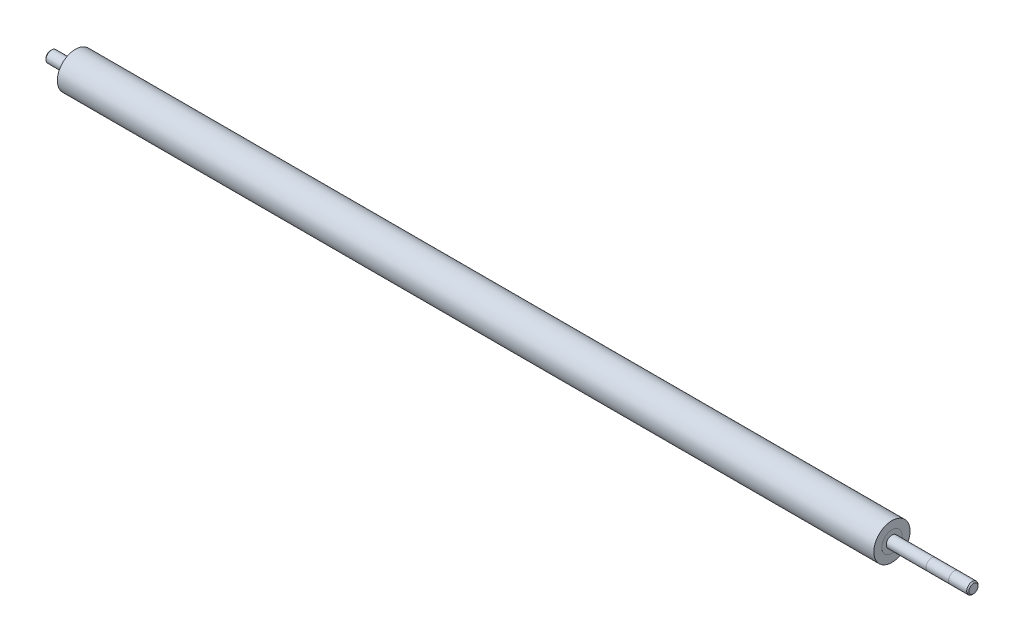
from build123d import *

# Parameters (mm, degrees)
SKETCH1_R               = 20
SKETCH1_R_2             = 7.5
EXTRUDE1_DEPTH          = 360.5
EXTRUDE2_DEPTH          = 362.607867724
EXTRUDE2_DEPTH_BACK     = 362.607867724
SKETCH2_R               = 9
EXTRUDE3_DEPTH          = 362.607867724
EXTRUDE3_DEPTH_BACK     = 362.607867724
SKETCH3_OUTSIDE_W       = 186.644
SKETCH3_OUTSIDE_H       = 186.644
SKETCH3_OUTSIDE_R       = 16
SKETCH4_R               = 9
SKETCH4_R_2             = 7
STAHLROHR_D18_X_2_DEPTH = 315.5
EXTRUDE5_DEPTH          = 72
EXTRUDE5_DEPTH_BACK     = 38
SKETCH6_R               = 5
CHAMFER1_SIZE           = 0.5
CHAMFER2_SIZE           = 1
EXTRUDE6_DEPTH          = 22
EXTRUDE6_DEPTH_BACK     = 38
SKETCH7_R               = 5
CHAMFER3_SIZE           = 0.5
CHAMFER4_SIZE           = 1


with BuildPart() as part:
    # Sketch1 → Extrude1 (new, symmetric)
    with BuildSketch(Plane(origin=(0, 0, 0), x_dir=(0, 0, -1), z_dir=(1, 0, 0))):
        Circle(SKETCH1_R)
        Circle(SKETCH1_R_2, mode=Mode.SUBTRACT)
    extrude(amount=EXTRUDE1_DEPTH, both=True)

    # Sketch2 → Extrude2 (cut, two sides: drawn at the far end of the back side and taken through both)
    with BuildSketch(Plane(origin=(0, 0, 0), x_dir=(0, 0, -1), z_dir=(1, 0, 0)).offset(-EXTRUDE2_DEPTH_BACK)):
        Circle(SKETCH2_R)
    extrude(amount=EXTRUDE2_DEPTH + EXTRUDE2_DEPTH_BACK, mode=Mode.SUBTRACT)

    # Sketch3 outside → Extrude3 (cut, two sides: drawn at the far end of the back side and taken through both)
    with BuildSketch(Plane(origin=(0, 0, 0), x_dir=(0, 0, -1), z_dir=(1, 0, 0)).offset(-EXTRUDE3_DEPTH_BACK)):
        Rectangle(SKETCH3_OUTSIDE_W, SKETCH3_OUTSIDE_H)
        Circle(SKETCH3_OUTSIDE_R, mode=Mode.SUBTRACT)
    extrude(amount=EXTRUDE3_DEPTH + EXTRUDE3_DEPTH_BACK, mode=Mode.SUBTRACT)


with BuildPart() as body_2:
    # Sketch4 → Stahlrohr d18 x 2 (new, symmetric)
    with BuildSketch(Plane(origin=(0, 0, 0), x_dir=(0, 0, -1), z_dir=(1, 0, 0))):
        Circle(SKETCH4_R)
        Circle(SKETCH4_R_2, mode=Mode.SUBTRACT)
    extrude(amount=STAHLROHR_D18_X_2_DEPTH, both=True)


with BuildPart() as body_3:
    # Sketch5 → Stopfen AS (revolve)
    with BuildSketch(Plane.XY):
        Polygon((298.5, 0), (298.5, 6), (299.5, 7), (318.5, 7), (318.5, 9), (360.5, 9), (360.5, 5), (322.5, 5), (322.5, 3), (320.767949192, 0), align=None)
    revolve(axis=Axis((360.5, 0, 0), (-1, 0, 0)))


with BuildPart() as body_4:
    # Stopfen RS: mirrored copy
    add(body_3.part.mirror(Plane(origin=(0, 0, 0), x_dir=(0, 0, 1), z_dir=(1, 0, 0))))


with BuildPart() as body_5:
    # Sketch6 → Extrude5 (new, two sides: drawn at the far end of the back side and taken through both)
    with BuildSketch(Plane(origin=(360.5, 0, 0), x_dir=(0, 0, -1), z_dir=(1, 0, 0)).offset(-EXTRUDE5_DEPTH_BACK)):
        with Locations(Location((0, 0, 0), (0, 0, 90))):
            Circle(SKETCH6_R)
    extrude(amount=EXTRUDE5_DEPTH + EXTRUDE5_DEPTH_BACK)

    # Chamfer1
    chamfer1_edges = [body_5.edges().sort_by_distance(p)[0] for p in [
        (322.5, -5, 0),
    ]]
    chamfer(chamfer1_edges, length=CHAMFER1_SIZE)

    # Chamfer2
    chamfer2_edges = [body_5.edges().sort_by_distance(p)[0] for p in [
        (432.5, -5, 0),
    ]]
    chamfer(chamfer2_edges, length=CHAMFER2_SIZE)


with BuildPart() as body_6:
    # Sketch7 → Extrude6 (new, two sides: drawn at the far end of the back side and taken through both)
    with BuildSketch(Plane.ZY.offset(360.5).offset(-EXTRUDE6_DEPTH_BACK)):
        with Locations(Location((0, 0, 0), (0, 0, 270))):
            Circle(SKETCH7_R)
    extrude(amount=EXTRUDE6_DEPTH + EXTRUDE6_DEPTH_BACK)

    # Chamfer3
    chamfer3_edges = [body_6.edges().sort_by_distance(p)[0] for p in [
        (-322.5, 5, 0),
    ]]
    chamfer(chamfer3_edges, length=CHAMFER3_SIZE)

    # Chamfer4
    chamfer4_edges = [body_6.edges().sort_by_distance(p)[0] for p in [
        (-382.5, 5, 0),
    ]]
    chamfer(chamfer4_edges, length=CHAMFER4_SIZE)


solid = Compound([part.part, body_2.part, body_3.part, body_4.part, body_5.part, body_6.part])
